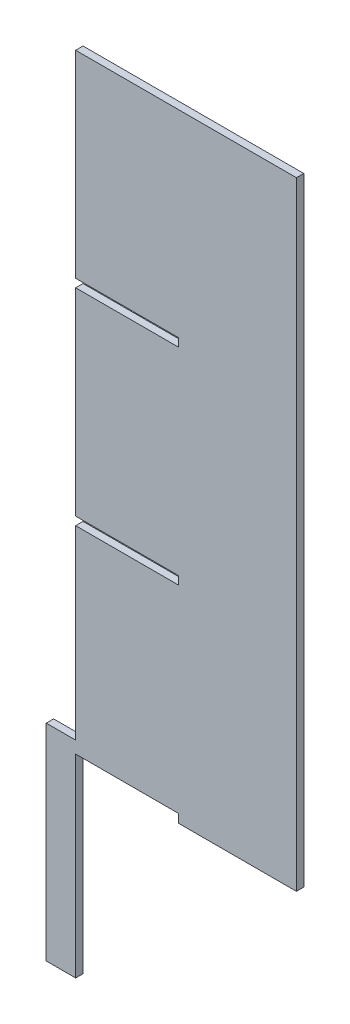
ISO-10303-21;
HEADER;
FILE_DESCRIPTION(('STEP AP214'),'2;1');
FILE_NAME('part.step','',(''),(''),'','','');
FILE_SCHEMA(('AUTOMOTIVE_DESIGN { 1 0 10303 214 1 1 1 1 }'));
ENDSEC;
DATA;
#1=APPLICATION_CONTEXT('core data for automotive mechanical design processes');
#2=APPLICATION_PROTOCOL_DEFINITION('international standard','automotive_design',2000,#1);
#3=PRODUCT_CONTEXT('',#1,'mechanical');
#4=PRODUCT('Part','Part','',(#3));
#5=PRODUCT_RELATED_PRODUCT_CATEGORY('part','',(#4));
#6=PRODUCT_DEFINITION_FORMATION('','',#4);
#7=PRODUCT_DEFINITION_CONTEXT('part definition',#1,'design');
#8=PRODUCT_DEFINITION('design','',#6,#7);
#9=PRODUCT_DEFINITION_SHAPE('','',#8);
#10=(LENGTH_UNIT() NAMED_UNIT(*) SI_UNIT(.MILLI.,.METRE.));
#11=(NAMED_UNIT(*) PLANE_ANGLE_UNIT() SI_UNIT($,.RADIAN.));
#12=(NAMED_UNIT(*) SI_UNIT($,.STERADIAN.) SOLID_ANGLE_UNIT());
#13=UNCERTAINTY_MEASURE_WITH_UNIT(LENGTH_MEASURE(1.E-05),#10,'distance_accuracy_value','');
#14=(GEOMETRIC_REPRESENTATION_CONTEXT(3) GLOBAL_UNCERTAINTY_ASSIGNED_CONTEXT((#13)) GLOBAL_UNIT_ASSIGNED_CONTEXT((#10,
#11,#12)) REPRESENTATION_CONTEXT('',''));
#15=CARTESIAN_POINT('',(0.,0.,0.));
#16=DIRECTION('',(0.,0.,1.));
#17=DIRECTION('',(1.,0.,0.));
#18=AXIS2_PLACEMENT_3D('',#15,#16,#17);
#19=CARTESIAN_POINT('',(-20.4989630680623,5.50144245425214,2.5));
#20=DIRECTION('',(1.,0.,0.));
#21=DIRECTION('',(0.,1.,0.));
#22=AXIS2_PLACEMENT_3D('',#19,#20,#21);
#23=PLANE('',#22);
#24=DIRECTION('',(0.,-1.,0.));
#25=VECTOR('',#24,1.);
#26=CARTESIAN_POINT('',(-20.4989630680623,5.50144245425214,0.));
#27=LINE('',#26,#25);
#28=CARTESIAN_POINT('',(-20.4989630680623,5.50144245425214,0.));
#29=VERTEX_POINT('',#28);
#30=CARTESIAN_POINT('',(-20.4989630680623,-64.4985575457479,0.));
#31=VERTEX_POINT('',#30);
#32=EDGE_CURVE('E204',#29,#31,#27,.T.);
#33=ORIENTED_EDGE('',*,*,#32,.T.);
#34=DIRECTION('',(0.,0.,-1.));
#35=VECTOR('',#34,1.);
#36=CARTESIAN_POINT('',(-20.4989630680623,-64.4985575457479,2.5));
#37=LINE('',#36,#35);
#38=CARTESIAN_POINT('',(-20.4989630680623,-64.4985575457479,2.5));
#39=VERTEX_POINT('',#38);
#40=EDGE_CURVE('E11',#39,#31,#37,.T.);
#41=ORIENTED_EDGE('',*,*,#40,.F.);
#42=DIRECTION('',(0.,-1.,0.));
#43=VECTOR('',#42,1.);
#44=CARTESIAN_POINT('',(-20.4989630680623,5.50144245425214,2.5));
#45=LINE('',#44,#43);
#46=CARTESIAN_POINT('',(-20.4989630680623,5.50144245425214,2.5));
#47=VERTEX_POINT('',#46);
#48=EDGE_CURVE('E256',#47,#39,#45,.T.);
#49=ORIENTED_EDGE('',*,*,#48,.F.);
#50=DIRECTION('',(0.,0.,-1.));
#51=VECTOR('',#50,1.);
#52=CARTESIAN_POINT('',(-20.4989630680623,5.50144245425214,2.5));
#53=LINE('',#52,#51);
#54=EDGE_CURVE('E200',#47,#29,#53,.T.);
#55=ORIENTED_EDGE('',*,*,#54,.T.);
#56=EDGE_LOOP('',(#33,#41,#49,#55));
#57=FACE_BOUND('',#56,.T.);
#58=ADVANCED_FACE('F43',(#57),#23,.F.);
#59=CARTESIAN_POINT('',(-20.4989630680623,-64.4985575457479,2.5));
#60=DIRECTION('',(0.,1.,0.));
#61=DIRECTION('',(0.,0.,1.));
#62=AXIS2_PLACEMENT_3D('',#59,#60,#61);
#63=PLANE('',#62);
#64=DIRECTION('',(1.,0.,0.));
#65=VECTOR('',#64,1.);
#66=CARTESIAN_POINT('',(-20.4989630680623,-64.4985575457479,0.));
#67=LINE('',#66,#65);
#68=CARTESIAN_POINT('',(-10.4989630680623,-64.4985575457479,0.));
#69=VERTEX_POINT('',#68);
#70=EDGE_CURVE('E208',#31,#69,#67,.T.);
#71=ORIENTED_EDGE('',*,*,#70,.T.);
#72=DIRECTION('',(0.,0.,-1.));
#73=VECTOR('',#72,1.);
#74=CARTESIAN_POINT('',(-10.4989630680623,-64.4985575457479,2.5));
#75=LINE('',#74,#73);
#76=CARTESIAN_POINT('',(-10.4989630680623,-64.4985575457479,2.5));
#77=VERTEX_POINT('',#76);
#78=EDGE_CURVE('E52',#77,#69,#75,.T.);
#79=ORIENTED_EDGE('',*,*,#78,.F.);
#80=DIRECTION('',(1.,0.,0.));
#81=VECTOR('',#80,1.);
#82=CARTESIAN_POINT('',(-20.4989630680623,-64.4985575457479,2.5));
#83=LINE('',#82,#81);
#84=EDGE_CURVE('E133',#39,#77,#83,.T.);
#85=ORIENTED_EDGE('',*,*,#84,.F.);
#86=ORIENTED_EDGE('',*,*,#40,.T.);
#87=EDGE_LOOP('',(#71,#79,#85,#86));
#88=FACE_BOUND('',#87,.T.);
#89=ADVANCED_FACE('F392',(#88),#63,.F.);
#90=CARTESIAN_POINT('',(-10.4989630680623,1.40000000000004,2.5));
#91=DIRECTION('',(-1.,0.,0.));
#92=DIRECTION('',(0.,-1.,0.));
#93=AXIS2_PLACEMENT_3D('',#90,#91,#92);
#94=PLANE('',#93);
#95=DIRECTION('',(0.,1.,0.));
#96=VECTOR('',#95,1.);
#97=CARTESIAN_POINT('',(-10.4989630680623,1.40000000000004,0.));
#98=LINE('',#97,#96);
#99=CARTESIAN_POINT('',(-10.4989630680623,1.40000000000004,0.));
#100=VERTEX_POINT('',#99);
#101=EDGE_CURVE('E211',#69,#100,#98,.T.);
#102=ORIENTED_EDGE('',*,*,#101,.T.);
#103=DIRECTION('',(0.,0.,-1.));
#104=VECTOR('',#103,1.);
#105=CARTESIAN_POINT('',(-10.4989630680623,1.40000000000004,2.5));
#106=LINE('',#105,#104);
#107=CARTESIAN_POINT('',(-10.4989630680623,1.40000000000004,2.5));
#108=VERTEX_POINT('',#107);
#109=EDGE_CURVE('E307',#108,#100,#106,.T.);
#110=ORIENTED_EDGE('',*,*,#109,.F.);
#111=DIRECTION('',(0.,1.,0.));
#112=VECTOR('',#111,1.);
#113=CARTESIAN_POINT('',(-10.4989630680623,1.40000000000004,2.5));
#114=LINE('',#113,#112);
#115=EDGE_CURVE('E317',#77,#108,#114,.T.);
#116=ORIENTED_EDGE('',*,*,#115,.F.);
#117=ORIENTED_EDGE('',*,*,#78,.T.);
#118=EDGE_LOOP('',(#102,#110,#116,#117));
#119=FACE_BOUND('',#118,.T.);
#120=ADVANCED_FACE('F315',(#119),#94,.F.);
#121=CARTESIAN_POINT('',(-10.4989630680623,1.40000000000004,2.5));
#122=DIRECTION('',(0.,1.,0.));
#123=DIRECTION('',(-1.,0.,0.));
#124=AXIS2_PLACEMENT_3D('',#121,#122,#123);
#125=PLANE('',#124);
#126=DIRECTION('',(1.,0.,0.));
#127=VECTOR('',#126,1.);
#128=CARTESIAN_POINT('',(-10.4989630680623,1.40000000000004,0.));
#129=LINE('',#128,#127);
#130=CARTESIAN_POINT('',(24.5010369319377,1.40000000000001,0.));
#131=VERTEX_POINT('',#130);
#132=EDGE_CURVE('E214',#100,#131,#129,.T.);
#133=ORIENTED_EDGE('',*,*,#132,.T.);
#134=DIRECTION('',(0.,0.,-1.));
#135=VECTOR('',#134,1.);
#136=CARTESIAN_POINT('',(24.5010369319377,1.40000000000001,2.5));
#137=LINE('',#136,#135);
#138=CARTESIAN_POINT('',(24.5010369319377,1.40000000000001,2.5));
#139=VERTEX_POINT('',#138);
#140=EDGE_CURVE('E303',#139,#131,#137,.T.);
#141=ORIENTED_EDGE('',*,*,#140,.F.);
#142=DIRECTION('',(1.,0.,0.));
#143=VECTOR('',#142,1.);
#144=CARTESIAN_POINT('',(-10.4989630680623,1.40000000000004,2.5));
#145=LINE('',#144,#143);
#146=EDGE_CURVE('E336',#108,#139,#145,.T.);
#147=ORIENTED_EDGE('',*,*,#146,.F.);
#148=ORIENTED_EDGE('',*,*,#109,.T.);
#149=EDGE_LOOP('',(#133,#141,#147,#148));
#150=FACE_BOUND('',#149,.T.);
#151=ADVANCED_FACE('F326',(#150),#125,.F.);
#152=CARTESIAN_POINT('',(24.5010369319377,1.40000000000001,2.5));
#153=DIRECTION('',(1.,0.,0.));
#154=DIRECTION('',(0.,1.,0.));
#155=AXIS2_PLACEMENT_3D('',#152,#153,#154);
#156=PLANE('',#155);
#157=DIRECTION('',(0.,-1.,0.));
#158=VECTOR('',#157,1.);
#159=CARTESIAN_POINT('',(24.5010369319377,1.40000000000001,0.));
#160=LINE('',#159,#158);
#161=CARTESIAN_POINT('',(24.5010369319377,-1.5,0.));
#162=VERTEX_POINT('',#161);
#163=EDGE_CURVE('E217',#131,#162,#160,.T.);
#164=ORIENTED_EDGE('',*,*,#163,.T.);
#165=DIRECTION('',(0.,0.,-1.));
#166=VECTOR('',#165,1.);
#167=CARTESIAN_POINT('',(24.5010369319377,-1.5,2.5));
#168=LINE('',#167,#166);
#169=CARTESIAN_POINT('',(24.5010369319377,-1.5,2.5));
#170=VERTEX_POINT('',#169);
#171=EDGE_CURVE('E299',#170,#162,#168,.T.);
#172=ORIENTED_EDGE('',*,*,#171,.F.);
#173=DIRECTION('',(0.,-1.,0.));
#174=VECTOR('',#173,1.);
#175=CARTESIAN_POINT('',(24.5010369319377,1.40000000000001,2.5));
#176=LINE('',#175,#174);
#177=EDGE_CURVE('E332',#139,#170,#176,.T.);
#178=ORIENTED_EDGE('',*,*,#177,.F.);
#179=ORIENTED_EDGE('',*,*,#140,.T.);
#180=EDGE_LOOP('',(#164,#172,#178,#179));
#181=FACE_BOUND('',#180,.T.);
#182=ADVANCED_FACE('F330',(#181),#156,.F.);
#183=CARTESIAN_POINT('',(24.5010369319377,-1.5,2.5));
#184=DIRECTION('',(0.,1.,0.));
#185=DIRECTION('',(0.,0.,1.));
#186=AXIS2_PLACEMENT_3D('',#183,#184,#185);
#187=PLANE('',#186);
#188=DIRECTION('',(1.,0.,0.));
#189=VECTOR('',#188,1.);
#190=CARTESIAN_POINT('',(24.5010369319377,-1.5,0.));
#191=LINE('',#190,#189);
#192=CARTESIAN_POINT('',(64.5010369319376,-1.5,0.));
#193=VERTEX_POINT('',#192);
#194=EDGE_CURVE('E220',#162,#193,#191,.T.);
#195=ORIENTED_EDGE('',*,*,#194,.T.);
#196=DIRECTION('',(0.,0.,-1.));
#197=VECTOR('',#196,1.);
#198=CARTESIAN_POINT('',(64.5010369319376,-1.5,2.5));
#199=LINE('',#198,#197);
#200=CARTESIAN_POINT('',(64.5010369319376,-1.5,2.5));
#201=VERTEX_POINT('',#200);
#202=EDGE_CURVE('E295',#201,#193,#199,.T.);
#203=ORIENTED_EDGE('',*,*,#202,.F.);
#204=DIRECTION('',(1.,0.,0.));
#205=VECTOR('',#204,1.);
#206=CARTESIAN_POINT('',(24.5010369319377,-1.5,2.5));
#207=LINE('',#206,#205);
#208=EDGE_CURVE('E335',#170,#201,#207,.T.);
#209=ORIENTED_EDGE('',*,*,#208,.F.);
#210=ORIENTED_EDGE('',*,*,#171,.T.);
#211=EDGE_LOOP('',(#195,#203,#209,#210));
#212=FACE_BOUND('',#211,.T.);
#213=ADVANCED_FACE('F405',(#212),#187,.F.);
#214=CARTESIAN_POINT('',(64.5010369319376,-1.5,2.5));
#215=DIRECTION('',(-1.,0.,0.));
#216=DIRECTION('',(0.,0.,1.));
#217=AXIS2_PLACEMENT_3D('',#214,#215,#216);
#218=PLANE('',#217);
#219=DIRECTION('',(0.,1.,0.));
#220=VECTOR('',#219,1.);
#221=CARTESIAN_POINT('',(64.5010369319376,-1.5,0.));
#222=LINE('',#221,#220);
#223=CARTESIAN_POINT('',(64.5010369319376,208.5,0.));
#224=VERTEX_POINT('',#223);
#225=EDGE_CURVE('E223',#193,#224,#222,.T.);
#226=ORIENTED_EDGE('',*,*,#225,.T.);
#227=DIRECTION('',(0.,0.,-1.));
#228=VECTOR('',#227,1.);
#229=CARTESIAN_POINT('',(64.5010369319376,208.5,2.5));
#230=LINE('',#229,#228);
#231=CARTESIAN_POINT('',(64.5010369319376,208.5,2.5));
#232=VERTEX_POINT('',#231);
#233=EDGE_CURVE('E291',#232,#224,#230,.T.);
#234=ORIENTED_EDGE('',*,*,#233,.F.);
#235=DIRECTION('',(0.,1.,0.));
#236=VECTOR('',#235,1.);
#237=CARTESIAN_POINT('',(64.5010369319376,-1.5,2.5));
#238=LINE('',#237,#236);
#239=EDGE_CURVE('E340',#201,#232,#238,.T.);
#240=ORIENTED_EDGE('',*,*,#239,.F.);
#241=ORIENTED_EDGE('',*,*,#202,.T.);
#242=EDGE_LOOP('',(#226,#234,#240,#241));
#243=FACE_BOUND('',#242,.T.);
#244=ADVANCED_FACE('F408',(#243),#218,.F.);
#245=CARTESIAN_POINT('',(64.5010369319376,208.5,2.5));
#246=DIRECTION('',(0.,-1.,0.));
#247=DIRECTION('',(0.,0.,-1.));
#248=AXIS2_PLACEMENT_3D('',#245,#246,#247);
#249=PLANE('',#248);
#250=DIRECTION('',(-1.,0.,0.));
#251=VECTOR('',#250,1.);
#252=CARTESIAN_POINT('',(64.5010369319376,208.5,0.));
#253=LINE('',#252,#251);
#254=CARTESIAN_POINT('',(-10.4989630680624,208.5,0.));
#255=VERTEX_POINT('',#254);
#256=EDGE_CURVE('E226',#224,#255,#253,.T.);
#257=ORIENTED_EDGE('',*,*,#256,.T.);
#258=DIRECTION('',(0.,0.,-1.));
#259=VECTOR('',#258,1.);
#260=CARTESIAN_POINT('',(-10.4989630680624,208.5,2.5));
#261=LINE('',#260,#259);
#262=CARTESIAN_POINT('',(-10.4989630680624,208.5,2.5));
#263=VERTEX_POINT('',#262);
#264=EDGE_CURVE('E287',#263,#255,#261,.T.);
#265=ORIENTED_EDGE('',*,*,#264,.F.);
#266=DIRECTION('',(-1.,0.,0.));
#267=VECTOR('',#266,1.);
#268=CARTESIAN_POINT('',(64.5010369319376,208.5,2.5));
#269=LINE('',#268,#267);
#270=EDGE_CURVE('E347',#232,#263,#269,.T.);
#271=ORIENTED_EDGE('',*,*,#270,.F.);
#272=ORIENTED_EDGE('',*,*,#233,.T.);
#273=EDGE_LOOP('',(#257,#265,#271,#272));
#274=FACE_BOUND('',#273,.T.);
#275=ADVANCED_FACE('F412',(#274),#249,.F.);
#276=CARTESIAN_POINT('',(-10.4989630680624,208.5,2.5));
#277=DIRECTION('',(1.,0.,0.));
#278=DIRECTION('',(0.,1.,0.));
#279=AXIS2_PLACEMENT_3D('',#276,#277,#278);
#280=PLANE('',#279);
#281=DIRECTION('',(0.,-1.,0.));
#282=VECTOR('',#281,1.);
#283=CARTESIAN_POINT('',(-10.4989630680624,208.5,0.));
#284=LINE('',#283,#282);
#285=CARTESIAN_POINT('',(-10.4989630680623,141.4,0.));
#286=VERTEX_POINT('',#285);
#287=EDGE_CURVE('E229',#255,#286,#284,.T.);
#288=ORIENTED_EDGE('',*,*,#287,.T.);
#289=DIRECTION('',(0.,0.,-1.));
#290=VECTOR('',#289,1.);
#291=CARTESIAN_POINT('',(-10.4989630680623,141.4,2.5));
#292=LINE('',#291,#290);
#293=CARTESIAN_POINT('',(-10.4989630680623,141.4,2.5));
#294=VERTEX_POINT('',#293);
#295=EDGE_CURVE('E283',#294,#286,#292,.T.);
#296=ORIENTED_EDGE('',*,*,#295,.F.);
#297=DIRECTION('',(0.,-1.,0.));
#298=VECTOR('',#297,1.);
#299=CARTESIAN_POINT('',(-10.4989630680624,208.5,2.5));
#300=LINE('',#299,#298);
#301=EDGE_CURVE('E350',#263,#294,#300,.T.);
#302=ORIENTED_EDGE('',*,*,#301,.F.);
#303=ORIENTED_EDGE('',*,*,#264,.T.);
#304=EDGE_LOOP('',(#288,#296,#302,#303));
#305=FACE_BOUND('',#304,.T.);
#306=ADVANCED_FACE('F416',(#305),#280,.F.);
#307=CARTESIAN_POINT('',(-10.4989630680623,141.4,2.5));
#308=DIRECTION('',(0.,1.,0.));
#309=DIRECTION('',(-1.,0.,0.));
#310=AXIS2_PLACEMENT_3D('',#307,#308,#309);
#311=PLANE('',#310);
#312=DIRECTION('',(1.,0.,0.));
#313=VECTOR('',#312,1.);
#314=CARTESIAN_POINT('',(-10.4989630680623,141.4,0.));
#315=LINE('',#314,#313);
#316=CARTESIAN_POINT('',(24.5010369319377,141.4,0.));
#317=VERTEX_POINT('',#316);
#318=EDGE_CURVE('E232',#286,#317,#315,.T.);
#319=ORIENTED_EDGE('',*,*,#318,.T.);
#320=DIRECTION('',(0.,0.,-1.));
#321=VECTOR('',#320,1.);
#322=CARTESIAN_POINT('',(24.5010369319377,141.4,2.5));
#323=LINE('',#322,#321);
#324=CARTESIAN_POINT('',(24.5010369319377,141.4,2.5));
#325=VERTEX_POINT('',#324);
#326=EDGE_CURVE('E279',#325,#317,#323,.T.);
#327=ORIENTED_EDGE('',*,*,#326,.F.);
#328=DIRECTION('',(1.,0.,0.));
#329=VECTOR('',#328,1.);
#330=CARTESIAN_POINT('',(-10.4989630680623,141.4,2.5));
#331=LINE('',#330,#329);
#332=EDGE_CURVE('E353',#294,#325,#331,.T.);
#333=ORIENTED_EDGE('',*,*,#332,.F.);
#334=ORIENTED_EDGE('',*,*,#295,.T.);
#335=EDGE_LOOP('',(#319,#327,#333,#334));
#336=FACE_BOUND('',#335,.T.);
#337=ADVANCED_FACE('F420',(#336),#311,.F.);
#338=CARTESIAN_POINT('',(24.5010369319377,141.4,2.5));
#339=DIRECTION('',(1.,0.,0.));
#340=DIRECTION('',(0.,1.,0.));
#341=AXIS2_PLACEMENT_3D('',#338,#339,#340);
#342=PLANE('',#341);
#343=DIRECTION('',(0.,-1.,0.));
#344=VECTOR('',#343,1.);
#345=CARTESIAN_POINT('',(24.5010369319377,141.4,0.));
#346=LINE('',#345,#344);
#347=CARTESIAN_POINT('',(24.5010369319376,138.6,0.));
#348=VERTEX_POINT('',#347);
#349=EDGE_CURVE('E235',#317,#348,#346,.T.);
#350=ORIENTED_EDGE('',*,*,#349,.T.);
#351=DIRECTION('',(0.,0.,-1.));
#352=VECTOR('',#351,1.);
#353=CARTESIAN_POINT('',(24.5010369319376,138.6,2.5));
#354=LINE('',#353,#352);
#355=CARTESIAN_POINT('',(24.5010369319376,138.6,2.5));
#356=VERTEX_POINT('',#355);
#357=EDGE_CURVE('E275',#356,#348,#354,.T.);
#358=ORIENTED_EDGE('',*,*,#357,.F.);
#359=DIRECTION('',(0.,-1.,0.));
#360=VECTOR('',#359,1.);
#361=CARTESIAN_POINT('',(24.5010369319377,141.4,2.5));
#362=LINE('',#361,#360);
#363=EDGE_CURVE('E356',#325,#356,#362,.T.);
#364=ORIENTED_EDGE('',*,*,#363,.F.);
#365=ORIENTED_EDGE('',*,*,#326,.T.);
#366=EDGE_LOOP('',(#350,#358,#364,#365));
#367=FACE_BOUND('',#366,.T.);
#368=ADVANCED_FACE('F424',(#367),#342,.F.);
#369=CARTESIAN_POINT('',(24.5010369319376,138.6,2.5));
#370=DIRECTION('',(0.,-1.,0.));
#371=DIRECTION('',(0.,0.,-1.));
#372=AXIS2_PLACEMENT_3D('',#369,#370,#371);
#373=PLANE('',#372);
#374=DIRECTION('',(-1.,0.,0.));
#375=VECTOR('',#374,1.);
#376=CARTESIAN_POINT('',(24.5010369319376,138.6,0.));
#377=LINE('',#376,#375);
#378=CARTESIAN_POINT('',(-10.4989630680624,138.6,0.));
#379=VERTEX_POINT('',#378);
#380=EDGE_CURVE('E238',#348,#379,#377,.T.);
#381=ORIENTED_EDGE('',*,*,#380,.T.);
#382=DIRECTION('',(0.,0.,-1.));
#383=VECTOR('',#382,1.);
#384=CARTESIAN_POINT('',(-10.4989630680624,138.6,2.5));
#385=LINE('',#384,#383);
#386=CARTESIAN_POINT('',(-10.4989630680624,138.6,2.5));
#387=VERTEX_POINT('',#386);
#388=EDGE_CURVE('E271',#387,#379,#385,.T.);
#389=ORIENTED_EDGE('',*,*,#388,.F.);
#390=DIRECTION('',(-1.,0.,0.));
#391=VECTOR('',#390,1.);
#392=CARTESIAN_POINT('',(24.5010369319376,138.6,2.5));
#393=LINE('',#392,#391);
#394=EDGE_CURVE('E359',#356,#387,#393,.T.);
#395=ORIENTED_EDGE('',*,*,#394,.F.);
#396=ORIENTED_EDGE('',*,*,#357,.T.);
#397=EDGE_LOOP('',(#381,#389,#395,#396));
#398=FACE_BOUND('',#397,.T.);
#399=ADVANCED_FACE('F428',(#398),#373,.F.);
#400=CARTESIAN_POINT('',(-10.4989630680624,138.6,2.5));
#401=DIRECTION('',(1.,0.,0.));
#402=DIRECTION('',(0.,1.,0.));
#403=AXIS2_PLACEMENT_3D('',#400,#401,#402);
#404=PLANE('',#403);
#405=DIRECTION('',(0.,-1.,0.));
#406=VECTOR('',#405,1.);
#407=CARTESIAN_POINT('',(-10.4989630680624,138.6,0.));
#408=LINE('',#407,#406);
#409=CARTESIAN_POINT('',(-10.4989630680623,71.4,0.));
#410=VERTEX_POINT('',#409);
#411=EDGE_CURVE('E241',#379,#410,#408,.T.);
#412=ORIENTED_EDGE('',*,*,#411,.T.);
#413=DIRECTION('',(0.,0.,-1.));
#414=VECTOR('',#413,1.);
#415=CARTESIAN_POINT('',(-10.4989630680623,71.4,2.5));
#416=LINE('',#415,#414);
#417=CARTESIAN_POINT('',(-10.4989630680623,71.4,2.5));
#418=VERTEX_POINT('',#417);
#419=EDGE_CURVE('E267',#418,#410,#416,.T.);
#420=ORIENTED_EDGE('',*,*,#419,.F.);
#421=DIRECTION('',(0.,-1.,0.));
#422=VECTOR('',#421,1.);
#423=CARTESIAN_POINT('',(-10.4989630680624,138.6,2.5));
#424=LINE('',#423,#422);
#425=EDGE_CURVE('E362',#387,#418,#424,.T.);
#426=ORIENTED_EDGE('',*,*,#425,.F.);
#427=ORIENTED_EDGE('',*,*,#388,.T.);
#428=EDGE_LOOP('',(#412,#420,#426,#427));
#429=FACE_BOUND('',#428,.T.);
#430=ADVANCED_FACE('F432',(#429),#404,.F.);
#431=CARTESIAN_POINT('',(-10.4989630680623,71.4,2.5));
#432=DIRECTION('',(0.,1.,0.));
#433=DIRECTION('',(-1.,0.,0.));
#434=AXIS2_PLACEMENT_3D('',#431,#432,#433);
#435=PLANE('',#434);
#436=DIRECTION('',(1.,0.,0.));
#437=VECTOR('',#436,1.);
#438=CARTESIAN_POINT('',(-10.4989630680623,71.4,0.));
#439=LINE('',#438,#437);
#440=CARTESIAN_POINT('',(24.5010369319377,71.4,0.));
#441=VERTEX_POINT('',#440);
#442=EDGE_CURVE('E244',#410,#441,#439,.T.);
#443=ORIENTED_EDGE('',*,*,#442,.T.);
#444=DIRECTION('',(0.,0.,-1.));
#445=VECTOR('',#444,1.);
#446=CARTESIAN_POINT('',(24.5010369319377,71.4,2.5));
#447=LINE('',#446,#445);
#448=CARTESIAN_POINT('',(24.5010369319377,71.4,2.5));
#449=VERTEX_POINT('',#448);
#450=EDGE_CURVE('E263',#449,#441,#447,.T.);
#451=ORIENTED_EDGE('',*,*,#450,.F.);
#452=DIRECTION('',(1.,0.,0.));
#453=VECTOR('',#452,1.);
#454=CARTESIAN_POINT('',(-10.4989630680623,71.4,2.5));
#455=LINE('',#454,#453);
#456=EDGE_CURVE('E365',#418,#449,#455,.T.);
#457=ORIENTED_EDGE('',*,*,#456,.F.);
#458=ORIENTED_EDGE('',*,*,#419,.T.);
#459=EDGE_LOOP('',(#443,#451,#457,#458));
#460=FACE_BOUND('',#459,.T.);
#461=ADVANCED_FACE('F373',(#460),#435,.F.);
#462=CARTESIAN_POINT('',(24.5010369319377,71.4,2.5));
#463=DIRECTION('',(1.,0.,0.));
#464=DIRECTION('',(0.,1.,0.));
#465=AXIS2_PLACEMENT_3D('',#462,#463,#464);
#466=PLANE('',#465);
#467=DIRECTION('',(0.,-1.,0.));
#468=VECTOR('',#467,1.);
#469=CARTESIAN_POINT('',(24.5010369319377,71.4,0.));
#470=LINE('',#469,#468);
#471=CARTESIAN_POINT('',(24.5010369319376,68.6,0.));
#472=VERTEX_POINT('',#471);
#473=EDGE_CURVE('E247',#441,#472,#470,.T.);
#474=ORIENTED_EDGE('',*,*,#473,.T.);
#475=DIRECTION('',(0.,0.,-1.));
#476=VECTOR('',#475,1.);
#477=CARTESIAN_POINT('',(24.5010369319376,68.6,2.5));
#478=LINE('',#477,#476);
#479=CARTESIAN_POINT('',(24.5010369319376,68.6,2.5));
#480=VERTEX_POINT('',#479);
#481=EDGE_CURVE('E193',#480,#472,#478,.T.);
#482=ORIENTED_EDGE('',*,*,#481,.F.);
#483=DIRECTION('',(0.,-1.,0.));
#484=VECTOR('',#483,1.);
#485=CARTESIAN_POINT('',(24.5010369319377,71.4,2.5));
#486=LINE('',#485,#484);
#487=EDGE_CURVE('E182',#449,#480,#486,.T.);
#488=ORIENTED_EDGE('',*,*,#487,.F.);
#489=ORIENTED_EDGE('',*,*,#450,.T.);
#490=EDGE_LOOP('',(#474,#482,#488,#489));
#491=FACE_BOUND('',#490,.T.);
#492=ADVANCED_FACE('F377',(#491),#466,.F.);
#493=CARTESIAN_POINT('',(24.5010369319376,68.6,2.5));
#494=DIRECTION('',(0.,-1.,0.));
#495=DIRECTION('',(0.,0.,-1.));
#496=AXIS2_PLACEMENT_3D('',#493,#494,#495);
#497=PLANE('',#496);
#498=DIRECTION('',(-1.,0.,0.));
#499=VECTOR('',#498,1.);
#500=CARTESIAN_POINT('',(24.5010369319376,68.6,0.));
#501=LINE('',#500,#499);
#502=CARTESIAN_POINT('',(-10.4989630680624,68.6,0.));
#503=VERTEX_POINT('',#502);
#504=EDGE_CURVE('E191',#472,#503,#501,.T.);
#505=ORIENTED_EDGE('',*,*,#504,.T.);
#506=DIRECTION('',(0.,0.,-1.));
#507=VECTOR('',#506,1.);
#508=CARTESIAN_POINT('',(-10.4989630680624,68.6,2.5));
#509=LINE('',#508,#507);
#510=CARTESIAN_POINT('',(-10.4989630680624,68.6,2.5));
#511=VERTEX_POINT('',#510);
#512=EDGE_CURVE('E188',#511,#503,#509,.T.);
#513=ORIENTED_EDGE('',*,*,#512,.F.);
#514=DIRECTION('',(-1.,0.,0.));
#515=VECTOR('',#514,1.);
#516=CARTESIAN_POINT('',(24.5010369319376,68.6,2.5));
#517=LINE('',#516,#515);
#518=EDGE_CURVE('E176',#480,#511,#517,.T.);
#519=ORIENTED_EDGE('',*,*,#518,.F.);
#520=ORIENTED_EDGE('',*,*,#481,.T.);
#521=EDGE_LOOP('',(#505,#513,#519,#520));
#522=FACE_BOUND('',#521,.T.);
#523=ADVANCED_FACE('F189',(#522),#497,.F.);
#524=CARTESIAN_POINT('',(-10.4989630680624,68.6,2.5));
#525=DIRECTION('',(1.,0.,0.));
#526=DIRECTION('',(0.,1.,0.));
#527=AXIS2_PLACEMENT_3D('',#524,#525,#526);
#528=PLANE('',#527);
#529=DIRECTION('',(0.,-1.,0.));
#530=VECTOR('',#529,1.);
#531=CARTESIAN_POINT('',(-10.4989630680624,68.6,0.));
#532=LINE('',#531,#530);
#533=CARTESIAN_POINT('',(-10.4989630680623,5.50144245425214,0.));
#534=VERTEX_POINT('',#533);
#535=EDGE_CURVE('E119',#503,#534,#532,.T.);
#536=ORIENTED_EDGE('',*,*,#535,.T.);
#537=DIRECTION('',(0.,0.,-1.));
#538=VECTOR('',#537,1.);
#539=CARTESIAN_POINT('',(-10.4989630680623,5.50144245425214,2.5));
#540=LINE('',#539,#538);
#541=CARTESIAN_POINT('',(-10.4989630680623,5.50144245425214,2.5));
#542=VERTEX_POINT('',#541);
#543=EDGE_CURVE('E194',#542,#534,#540,.T.);
#544=ORIENTED_EDGE('',*,*,#543,.F.);
#545=DIRECTION('',(0.,-1.,0.));
#546=VECTOR('',#545,1.);
#547=CARTESIAN_POINT('',(-10.4989630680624,68.6,2.5));
#548=LINE('',#547,#546);
#549=EDGE_CURVE('E180',#511,#542,#548,.T.);
#550=ORIENTED_EDGE('',*,*,#549,.F.);
#551=ORIENTED_EDGE('',*,*,#512,.T.);
#552=EDGE_LOOP('',(#536,#544,#550,#551));
#553=FACE_BOUND('',#552,.T.);
#554=ADVANCED_FACE('F196',(#553),#528,.F.);
#555=CARTESIAN_POINT('',(-20.4989630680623,5.50144245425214,2.5));
#556=DIRECTION('',(0.,-1.,0.));
#557=DIRECTION('',(0.,0.,-1.));
#558=AXIS2_PLACEMENT_3D('',#555,#556,#557);
#559=PLANE('',#558);
#560=DIRECTION('',(-1.,0.,0.));
#561=VECTOR('',#560,1.);
#562=CARTESIAN_POINT('',(-20.4989630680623,5.50144245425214,0.));
#563=LINE('',#562,#561);
#564=EDGE_CURVE('E125',#534,#29,#563,.T.);
#565=ORIENTED_EDGE('',*,*,#564,.T.);
#566=ORIENTED_EDGE('',*,*,#54,.F.);
#567=DIRECTION('',(-1.,0.,0.));
#568=VECTOR('',#567,1.);
#569=CARTESIAN_POINT('',(-20.4989630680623,5.50144245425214,2.5));
#570=LINE('',#569,#568);
#571=EDGE_CURVE('E60',#542,#47,#570,.T.);
#572=ORIENTED_EDGE('',*,*,#571,.F.);
#573=ORIENTED_EDGE('',*,*,#543,.T.);
#574=EDGE_LOOP('',(#565,#566,#572,#573));
#575=FACE_BOUND('',#574,.T.);
#576=ADVANCED_FACE('F381',(#575),#559,.F.);
#577=CARTESIAN_POINT('',(0.,0.,2.5));
#578=DIRECTION('',(0.,0.,1.));
#579=DIRECTION('',(1.,0.,0.));
#580=AXIS2_PLACEMENT_3D('',#577,#578,#579);
#581=PLANE('',#580);
#582=ORIENTED_EDGE('',*,*,#48,.T.);
#583=ORIENTED_EDGE('',*,*,#84,.T.);
#584=ORIENTED_EDGE('',*,*,#115,.T.);
#585=ORIENTED_EDGE('',*,*,#146,.T.);
#586=ORIENTED_EDGE('',*,*,#177,.T.);
#587=ORIENTED_EDGE('',*,*,#208,.T.);
#588=ORIENTED_EDGE('',*,*,#239,.T.);
#589=ORIENTED_EDGE('',*,*,#270,.T.);
#590=ORIENTED_EDGE('',*,*,#301,.T.);
#591=ORIENTED_EDGE('',*,*,#332,.T.);
#592=ORIENTED_EDGE('',*,*,#363,.T.);
#593=ORIENTED_EDGE('',*,*,#394,.T.);
#594=ORIENTED_EDGE('',*,*,#425,.T.);
#595=ORIENTED_EDGE('',*,*,#456,.T.);
#596=ORIENTED_EDGE('',*,*,#487,.T.);
#597=ORIENTED_EDGE('',*,*,#518,.T.);
#598=ORIENTED_EDGE('',*,*,#549,.T.);
#599=ORIENTED_EDGE('',*,*,#571,.T.);
#600=EDGE_LOOP('',(#582,#583,#584,#585,#586,#587,#588,#589,#590,#591,#592,#593,#594,#595,#596,
#597,#598,#599));
#601=FACE_BOUND('',#600,.T.);
#602=ADVANCED_FACE('F178',(#601),#581,.T.);
#603=CARTESIAN_POINT('',(0.,0.,0.));
#604=DIRECTION('',(0.,0.,1.));
#605=DIRECTION('',(1.,0.,0.));
#606=AXIS2_PLACEMENT_3D('',#603,#604,#605);
#607=PLANE('',#606);
#608=ORIENTED_EDGE('',*,*,#32,.F.);
#609=ORIENTED_EDGE('',*,*,#564,.F.);
#610=ORIENTED_EDGE('',*,*,#535,.F.);
#611=ORIENTED_EDGE('',*,*,#504,.F.);
#612=ORIENTED_EDGE('',*,*,#473,.F.);
#613=ORIENTED_EDGE('',*,*,#442,.F.);
#614=ORIENTED_EDGE('',*,*,#411,.F.);
#615=ORIENTED_EDGE('',*,*,#380,.F.);
#616=ORIENTED_EDGE('',*,*,#349,.F.);
#617=ORIENTED_EDGE('',*,*,#318,.F.);
#618=ORIENTED_EDGE('',*,*,#287,.F.);
#619=ORIENTED_EDGE('',*,*,#256,.F.);
#620=ORIENTED_EDGE('',*,*,#225,.F.);
#621=ORIENTED_EDGE('',*,*,#194,.F.);
#622=ORIENTED_EDGE('',*,*,#163,.F.);
#623=ORIENTED_EDGE('',*,*,#132,.F.);
#624=ORIENTED_EDGE('',*,*,#101,.F.);
#625=ORIENTED_EDGE('',*,*,#70,.F.);
#626=EDGE_LOOP('',(#608,#609,#610,#611,#612,#613,#614,#615,#616,#617,#618,#619,#620,#621,#622,
#623,#624,#625));
#627=FACE_BOUND('',#626,.T.);
#628=ADVANCED_FACE('F321',(#627),#607,.F.);
#629=CLOSED_SHELL('',(#58,#89,#120,#151,#182,#213,#244,#275,#306,#337,#368,#399,#430,#461,#492,
#523,#554,#576,#602,#628));
#630=MANIFOLD_SOLID_BREP('B2',#629);
#631=ADVANCED_BREP_SHAPE_REPRESENTATION('',(#18,#630),#14);
#632=SHAPE_DEFINITION_REPRESENTATION(#9,#631);
ENDSEC;
END-ISO-10303-21;
